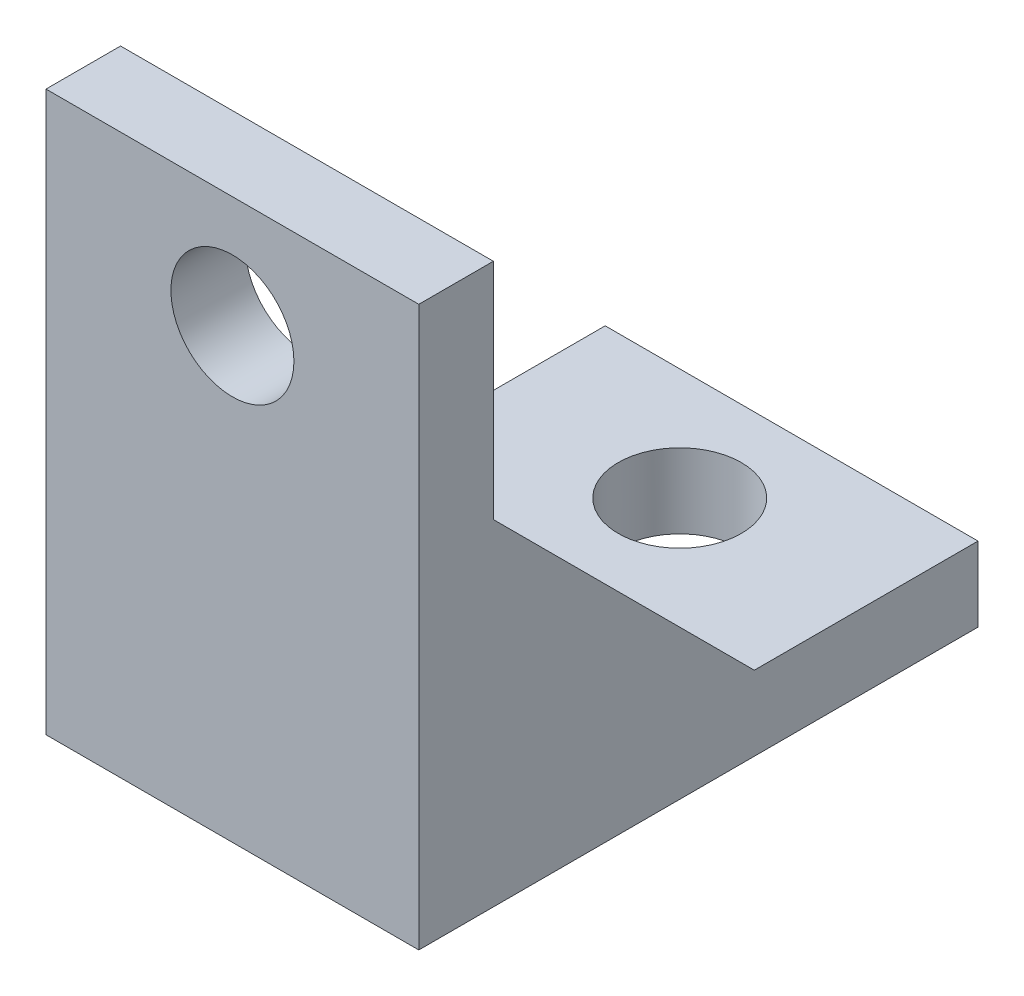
ISO-10303-21;
HEADER;
FILE_DESCRIPTION(('STEP AP214'),'2;1');
FILE_NAME('part.step','',(''),(''),'','','');
FILE_SCHEMA(('AUTOMOTIVE_DESIGN { 1 0 10303 214 1 1 1 1 }'));
ENDSEC;
DATA;
#1=APPLICATION_CONTEXT('core data for automotive mechanical design processes');
#2=APPLICATION_PROTOCOL_DEFINITION('international standard','automotive_design',2000,#1);
#3=PRODUCT_CONTEXT('',#1,'mechanical');
#4=PRODUCT('Part','Part','',(#3));
#5=PRODUCT_RELATED_PRODUCT_CATEGORY('part','',(#4));
#6=PRODUCT_DEFINITION_FORMATION('','',#4);
#7=PRODUCT_DEFINITION_CONTEXT('part definition',#1,'design');
#8=PRODUCT_DEFINITION('design','',#6,#7);
#9=PRODUCT_DEFINITION_SHAPE('','',#8);
#10=(LENGTH_UNIT() NAMED_UNIT(*) SI_UNIT(.MILLI.,.METRE.));
#11=(NAMED_UNIT(*) PLANE_ANGLE_UNIT() SI_UNIT($,.RADIAN.));
#12=(NAMED_UNIT(*) SI_UNIT($,.STERADIAN.) SOLID_ANGLE_UNIT());
#13=UNCERTAINTY_MEASURE_WITH_UNIT(LENGTH_MEASURE(1.E-05),#10,'distance_accuracy_value','');
#14=(GEOMETRIC_REPRESENTATION_CONTEXT(3) GLOBAL_UNCERTAINTY_ASSIGNED_CONTEXT((#13)) GLOBAL_UNIT_ASSIGNED_CONTEXT((#10,
#11,#12)) REPRESENTATION_CONTEXT('',''));
#15=CARTESIAN_POINT('',(0.,0.,0.));
#16=DIRECTION('',(0.,0.,1.));
#17=DIRECTION('',(1.,0.,0.));
#18=AXIS2_PLACEMENT_3D('',#15,#16,#17);
#19=CARTESIAN_POINT('',(10.,0.,-15.));
#20=DIRECTION('',(0.,1.,0.));
#21=DIRECTION('',(0.,0.,1.));
#22=AXIS2_PLACEMENT_3D('',#19,#20,#21);
#23=PLANE('',#22);
#24=CARTESIAN_POINT('',(5.,0.,-12.));
#25=DIRECTION('',(0.,1.,0.));
#26=DIRECTION('',(0.,0.,1.));
#27=AXIS2_PLACEMENT_3D('',#24,#25,#26);
#28=CIRCLE('',#27,1.65);
#29=CARTESIAN_POINT('',(5.,0.,-10.35));
#30=VERTEX_POINT('',#29);
#31=EDGE_CURVE('E133',#30,#30,#28,.F.);
#32=ORIENTED_EDGE('',*,*,#31,.F.);
#33=EDGE_LOOP('',(#32));
#34=FACE_BOUND('',#33,.T.);
#35=DIRECTION('',(-1.,0.,0.));
#36=VECTOR('',#35,1.);
#37=CARTESIAN_POINT('',(10.,0.,-15.));
#38=LINE('',#37,#36);
#39=CARTESIAN_POINT('',(10.,0.,-15.));
#40=VERTEX_POINT('',#39);
#41=CARTESIAN_POINT('',(0.,0.,-15.));
#42=VERTEX_POINT('',#41);
#43=EDGE_CURVE('E11',#40,#42,#38,.T.);
#44=ORIENTED_EDGE('',*,*,#43,.F.);
#45=DIRECTION('',(0.,0.,-1.));
#46=VECTOR('',#45,1.);
#47=CARTESIAN_POINT('',(10.,0.,-15.));
#48=LINE('',#47,#46);
#49=CARTESIAN_POINT('',(10.,0.,0.));
#50=VERTEX_POINT('',#49);
#51=EDGE_CURVE('E105',#50,#40,#48,.T.);
#52=ORIENTED_EDGE('',*,*,#51,.F.);
#53=DIRECTION('',(-1.,0.,0.));
#54=VECTOR('',#53,1.);
#55=CARTESIAN_POINT('',(10.,0.,0.));
#56=LINE('',#55,#54);
#57=CARTESIAN_POINT('',(0.,0.,0.));
#58=VERTEX_POINT('',#57);
#59=EDGE_CURVE('E128',#50,#58,#56,.T.);
#60=ORIENTED_EDGE('',*,*,#59,.T.);
#61=DIRECTION('',(0.,0.,-1.));
#62=VECTOR('',#61,1.);
#63=CARTESIAN_POINT('',(0.,0.,-15.));
#64=LINE('',#63,#62);
#65=EDGE_CURVE('E126',#58,#42,#64,.T.);
#66=ORIENTED_EDGE('',*,*,#65,.T.);
#67=EDGE_LOOP('',(#44,#52,#60,#66));
#68=FACE_BOUND('',#67,.T.);
#69=ADVANCED_FACE('F45',(#34,#68),#23,.F.);
#70=CARTESIAN_POINT('',(10.,2.,-15.));
#71=DIRECTION('',(0.,0.,1.));
#72=DIRECTION('',(1.,0.,0.));
#73=AXIS2_PLACEMENT_3D('',#70,#71,#72);
#74=PLANE('',#73);
#75=DIRECTION('',(0.,1.,0.));
#76=VECTOR('',#75,1.);
#77=CARTESIAN_POINT('',(0.,2.,-15.));
#78=LINE('',#77,#76);
#79=CARTESIAN_POINT('',(0.,2.,-15.));
#80=VERTEX_POINT('',#79);
#81=EDGE_CURVE('E132',#42,#80,#78,.T.);
#82=ORIENTED_EDGE('',*,*,#81,.T.);
#83=DIRECTION('',(-1.,0.,0.));
#84=VECTOR('',#83,1.);
#85=CARTESIAN_POINT('',(10.,2.,-15.));
#86=LINE('',#85,#84);
#87=CARTESIAN_POINT('',(10.,2.,-15.));
#88=VERTEX_POINT('',#87);
#89=EDGE_CURVE('E54',#88,#80,#86,.T.);
#90=ORIENTED_EDGE('',*,*,#89,.F.);
#91=DIRECTION('',(0.,1.,0.));
#92=VECTOR('',#91,1.);
#93=CARTESIAN_POINT('',(10.,2.,-15.));
#94=LINE('',#93,#92);
#95=EDGE_CURVE('E108',#40,#88,#94,.T.);
#96=ORIENTED_EDGE('',*,*,#95,.F.);
#97=ORIENTED_EDGE('',*,*,#43,.T.);
#98=EDGE_LOOP('',(#82,#90,#96,#97));
#99=FACE_BOUND('',#98,.T.);
#100=ADVANCED_FACE('F120',(#99),#74,.F.);
#101=CARTESIAN_POINT('',(10.,2.,-2.));
#102=DIRECTION('',(0.,-1.,0.));
#103=DIRECTION('',(0.,0.,-1.));
#104=AXIS2_PLACEMENT_3D('',#101,#102,#103);
#105=PLANE('',#104);
#106=CARTESIAN_POINT('',(5.,2.,-12.));
#107=DIRECTION('',(0.,-1.,0.));
#108=DIRECTION('',(0.,0.,-1.));
#109=AXIS2_PLACEMENT_3D('',#106,#107,#108);
#110=CIRCLE('',#109,1.65);
#111=CARTESIAN_POINT('',(5.,2.,-13.65));
#112=VERTEX_POINT('',#111);
#113=EDGE_CURVE('E48',#112,#112,#110,.F.);
#114=ORIENTED_EDGE('',*,*,#113,.F.);
#115=EDGE_LOOP('',(#114));
#116=FACE_BOUND('',#115,.T.);
#117=DIRECTION('',(0.,0.,1.));
#118=VECTOR('',#117,1.);
#119=CARTESIAN_POINT('',(0.,2.,-2.));
#120=LINE('',#119,#118);
#121=CARTESIAN_POINT('',(0.,2.,-9.));
#122=VERTEX_POINT('',#121);
#123=EDGE_CURVE('E139',#80,#122,#120,.T.);
#124=ORIENTED_EDGE('',*,*,#123,.T.);
#125=DIRECTION('',(-1.,0.,0.));
#126=VECTOR('',#125,1.);
#127=CARTESIAN_POINT('',(10.,2.,-9.));
#128=LINE('',#127,#126);
#129=CARTESIAN_POINT('',(10.,2.,-9.));
#130=VERTEX_POINT('',#129);
#131=EDGE_CURVE('E69',#122,#130,#128,.F.);
#132=ORIENTED_EDGE('',*,*,#131,.T.);
#133=DIRECTION('',(0.,0.,1.));
#134=VECTOR('',#133,1.);
#135=CARTESIAN_POINT('',(10.,2.,-2.));
#136=LINE('',#135,#134);
#137=EDGE_CURVE('E123',#88,#130,#136,.T.);
#138=ORIENTED_EDGE('',*,*,#137,.F.);
#139=ORIENTED_EDGE('',*,*,#89,.T.);
#140=EDGE_LOOP('',(#124,#132,#138,#139));
#141=FACE_BOUND('',#140,.T.);
#142=ADVANCED_FACE('F165',(#116,#141),#105,.F.);
#143=CARTESIAN_POINT('',(10.,15.,-2.));
#144=DIRECTION('',(0.,0.,1.));
#145=DIRECTION('',(0.,-1.,0.));
#146=AXIS2_PLACEMENT_3D('',#143,#144,#145);
#147=PLANE('',#146);
#148=CARTESIAN_POINT('',(5.,12.,-2.));
#149=DIRECTION('',(0.,0.,1.));
#150=DIRECTION('',(0.,-1.,0.));
#151=AXIS2_PLACEMENT_3D('',#148,#149,#150);
#152=CIRCLE('',#151,1.65);
#153=CARTESIAN_POINT('',(5.,10.35,-2.));
#154=VERTEX_POINT('',#153);
#155=EDGE_CURVE('E202',#154,#154,#152,.T.);
#156=ORIENTED_EDGE('',*,*,#155,.T.);
#157=EDGE_LOOP('',(#156));
#158=FACE_BOUND('',#157,.T.);
#159=DIRECTION('',(0.,1.,0.));
#160=VECTOR('',#159,1.);
#161=CARTESIAN_POINT('',(10.,15.,-2.));
#162=LINE('',#161,#160);
#163=CARTESIAN_POINT('',(10.,9.,-2.));
#164=VERTEX_POINT('',#163);
#165=CARTESIAN_POINT('',(10.,15.,-2.));
#166=VERTEX_POINT('',#165);
#167=EDGE_CURVE('E61',#164,#166,#162,.T.);
#168=ORIENTED_EDGE('',*,*,#167,.F.);
#169=DIRECTION('',(1.,0.,0.));
#170=VECTOR('',#169,1.);
#171=CARTESIAN_POINT('',(10.,9.,-2.));
#172=LINE('',#171,#170);
#173=CARTESIAN_POINT('',(0.,9.,-2.));
#174=VERTEX_POINT('',#173);
#175=EDGE_CURVE('E187',#164,#174,#172,.F.);
#176=ORIENTED_EDGE('',*,*,#175,.T.);
#177=DIRECTION('',(0.,1.,0.));
#178=VECTOR('',#177,1.);
#179=CARTESIAN_POINT('',(0.,15.,-2.));
#180=LINE('',#179,#178);
#181=CARTESIAN_POINT('',(0.,15.,-2.));
#182=VERTEX_POINT('',#181);
#183=EDGE_CURVE('E143',#174,#182,#180,.T.);
#184=ORIENTED_EDGE('',*,*,#183,.T.);
#185=DIRECTION('',(-1.,0.,0.));
#186=VECTOR('',#185,1.);
#187=CARTESIAN_POINT('',(10.,15.,-2.));
#188=LINE('',#187,#186);
#189=EDGE_CURVE('E160',#166,#182,#188,.T.);
#190=ORIENTED_EDGE('',*,*,#189,.F.);
#191=EDGE_LOOP('',(#168,#176,#184,#190));
#192=FACE_BOUND('',#191,.T.);
#193=ADVANCED_FACE('F217',(#158,#192),#147,.F.);
#194=CARTESIAN_POINT('',(10.,15.,0.));
#195=DIRECTION('',(0.,-1.,0.));
#196=DIRECTION('',(0.,0.,-1.));
#197=AXIS2_PLACEMENT_3D('',#194,#195,#196);
#198=PLANE('',#197);
#199=DIRECTION('',(0.,0.,1.));
#200=VECTOR('',#199,1.);
#201=CARTESIAN_POINT('',(0.,15.,0.));
#202=LINE('',#201,#200);
#203=CARTESIAN_POINT('',(0.,15.,0.));
#204=VERTEX_POINT('',#203);
#205=EDGE_CURVE('E149',#182,#204,#202,.T.);
#206=ORIENTED_EDGE('',*,*,#205,.T.);
#207=DIRECTION('',(-1.,0.,0.));
#208=VECTOR('',#207,1.);
#209=CARTESIAN_POINT('',(10.,15.,0.));
#210=LINE('',#209,#208);
#211=CARTESIAN_POINT('',(10.,15.,0.));
#212=VERTEX_POINT('',#211);
#213=EDGE_CURVE('E156',#212,#204,#210,.T.);
#214=ORIENTED_EDGE('',*,*,#213,.F.);
#215=DIRECTION('',(0.,0.,1.));
#216=VECTOR('',#215,1.);
#217=CARTESIAN_POINT('',(10.,15.,0.));
#218=LINE('',#217,#216);
#219=EDGE_CURVE('E171',#166,#212,#218,.T.);
#220=ORIENTED_EDGE('',*,*,#219,.F.);
#221=ORIENTED_EDGE('',*,*,#189,.T.);
#222=EDGE_LOOP('',(#206,#214,#220,#221));
#223=FACE_BOUND('',#222,.T.);
#224=ADVANCED_FACE('F179',(#223),#198,.F.);
#225=CARTESIAN_POINT('',(10.,0.,0.));
#226=DIRECTION('',(0.,0.,-1.));
#227=DIRECTION('',(-1.,0.,0.));
#228=AXIS2_PLACEMENT_3D('',#225,#226,#227);
#229=PLANE('',#228);
#230=CARTESIAN_POINT('',(5.,12.,0.));
#231=DIRECTION('',(0.,0.,1.));
#232=DIRECTION('',(1.,0.,0.));
#233=AXIS2_PLACEMENT_3D('',#230,#231,#232);
#234=CIRCLE('',#233,1.65);
#235=CARTESIAN_POINT('',(6.65,12.,0.));
#236=VERTEX_POINT('',#235);
#237=EDGE_CURVE('E198',#236,#236,#234,.T.);
#238=ORIENTED_EDGE('',*,*,#237,.F.);
#239=EDGE_LOOP('',(#238));
#240=FACE_BOUND('',#239,.T.);
#241=DIRECTION('',(0.,-1.,0.));
#242=VECTOR('',#241,1.);
#243=CARTESIAN_POINT('',(0.,0.,0.));
#244=LINE('',#243,#242);
#245=EDGE_CURVE('E117',#204,#58,#244,.T.);
#246=ORIENTED_EDGE('',*,*,#245,.T.);
#247=ORIENTED_EDGE('',*,*,#59,.F.);
#248=DIRECTION('',(0.,-1.,0.));
#249=VECTOR('',#248,1.);
#250=CARTESIAN_POINT('',(10.,0.,0.));
#251=LINE('',#250,#249);
#252=EDGE_CURVE('E111',#212,#50,#251,.T.);
#253=ORIENTED_EDGE('',*,*,#252,.F.);
#254=ORIENTED_EDGE('',*,*,#213,.T.);
#255=EDGE_LOOP('',(#246,#247,#253,#254));
#256=FACE_BOUND('',#255,.T.);
#257=ADVANCED_FACE('F182',(#240,#256),#229,.F.);
#258=CARTESIAN_POINT('',(10.,0.,0.));
#259=DIRECTION('',(-1.,0.,0.));
#260=DIRECTION('',(0.,0.,1.));
#261=AXIS2_PLACEMENT_3D('',#258,#259,#260);
#262=PLANE('',#261);
#263=ORIENTED_EDGE('',*,*,#137,.T.);
#264=DIRECTION('',(0.,-0.707106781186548,-0.707106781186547));
#265=VECTOR('',#264,1.);
#266=CARTESIAN_POINT('',(10.,9.,-2.));
#267=LINE('',#266,#265);
#268=EDGE_CURVE('E189',#164,#130,#267,.T.);
#269=ORIENTED_EDGE('',*,*,#268,.F.);
#270=ORIENTED_EDGE('',*,*,#167,.T.);
#271=ORIENTED_EDGE('',*,*,#219,.T.);
#272=ORIENTED_EDGE('',*,*,#252,.T.);
#273=ORIENTED_EDGE('',*,*,#51,.T.);
#274=ORIENTED_EDGE('',*,*,#95,.T.);
#275=EDGE_LOOP('',(#263,#269,#270,#271,#272,#273,#274));
#276=FACE_BOUND('',#275,.T.);
#277=ADVANCED_FACE('F107',(#276),#262,.F.);
#278=CARTESIAN_POINT('',(0.,0.,0.));
#279=DIRECTION('',(-1.,0.,0.));
#280=DIRECTION('',(0.,0.,1.));
#281=AXIS2_PLACEMENT_3D('',#278,#279,#280);
#282=PLANE('',#281);
#283=ORIENTED_EDGE('',*,*,#183,.F.);
#284=DIRECTION('',(0.,-0.707106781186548,-0.707106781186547));
#285=VECTOR('',#284,1.);
#286=CARTESIAN_POINT('',(0.,9.,-2.));
#287=LINE('',#286,#285);
#288=EDGE_CURVE('E184',#174,#122,#287,.T.);
#289=ORIENTED_EDGE('',*,*,#288,.T.);
#290=ORIENTED_EDGE('',*,*,#123,.F.);
#291=ORIENTED_EDGE('',*,*,#81,.F.);
#292=ORIENTED_EDGE('',*,*,#65,.F.);
#293=ORIENTED_EDGE('',*,*,#245,.F.);
#294=ORIENTED_EDGE('',*,*,#205,.F.);
#295=EDGE_LOOP('',(#283,#289,#290,#291,#292,#293,#294));
#296=FACE_BOUND('',#295,.T.);
#297=ADVANCED_FACE('F137',(#296),#282,.T.);
#298=CARTESIAN_POINT('',(5.,15.,-12.));
#299=DIRECTION('',(0.,-1.,0.));
#300=DIRECTION('',(0.,0.,-1.));
#301=AXIS2_PLACEMENT_3D('',#298,#299,#300);
#302=CYLINDRICAL_SURFACE('',#301,1.65);
#303=ORIENTED_EDGE('',*,*,#31,.T.);
#304=EDGE_LOOP('',(#303));
#305=FACE_BOUND('',#304,.T.);
#306=ORIENTED_EDGE('',*,*,#113,.T.);
#307=EDGE_LOOP('',(#306));
#308=FACE_BOUND('',#307,.T.);
#309=ADVANCED_FACE('F214',(#305,#308),#302,.F.);
#310=CARTESIAN_POINT('',(5.,12.,-15.));
#311=DIRECTION('',(0.,0.,1.));
#312=DIRECTION('',(1.,0.,0.));
#313=AXIS2_PLACEMENT_3D('',#310,#311,#312);
#314=CYLINDRICAL_SURFACE('',#313,1.65);
#315=ORIENTED_EDGE('',*,*,#237,.T.);
#316=EDGE_LOOP('',(#315));
#317=FACE_BOUND('',#316,.T.);
#318=ORIENTED_EDGE('',*,*,#155,.F.);
#319=EDGE_LOOP('',(#318));
#320=FACE_BOUND('',#319,.T.);
#321=ADVANCED_FACE('F283',(#317,#320),#314,.F.);
#322=CARTESIAN_POINT('',(0.,9.,-2.));
#323=DIRECTION('',(0.,-0.707106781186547,0.707106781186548));
#324=DIRECTION('',(0.,-0.707106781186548,-0.707106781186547));
#325=AXIS2_PLACEMENT_3D('',#322,#323,#324);
#326=PLANE('',#325);
#327=ORIENTED_EDGE('',*,*,#131,.F.);
#328=ORIENTED_EDGE('',*,*,#288,.F.);
#329=ORIENTED_EDGE('',*,*,#175,.F.);
#330=ORIENTED_EDGE('',*,*,#268,.T.);
#331=EDGE_LOOP('',(#327,#328,#329,#330));
#332=FACE_BOUND('',#331,.T.);
#333=ADVANCED_FACE('F186',(#332),#326,.F.);
#334=CLOSED_SHELL('',(#69,#100,#142,#193,#224,#257,#277,#297,#309,#321,#333));
#335=MANIFOLD_SOLID_BREP('B2',#334);
#336=ADVANCED_BREP_SHAPE_REPRESENTATION('',(#18,#335),#14);
#337=SHAPE_DEFINITION_REPRESENTATION(#9,#336);
ENDSEC;
END-ISO-10303-21;
